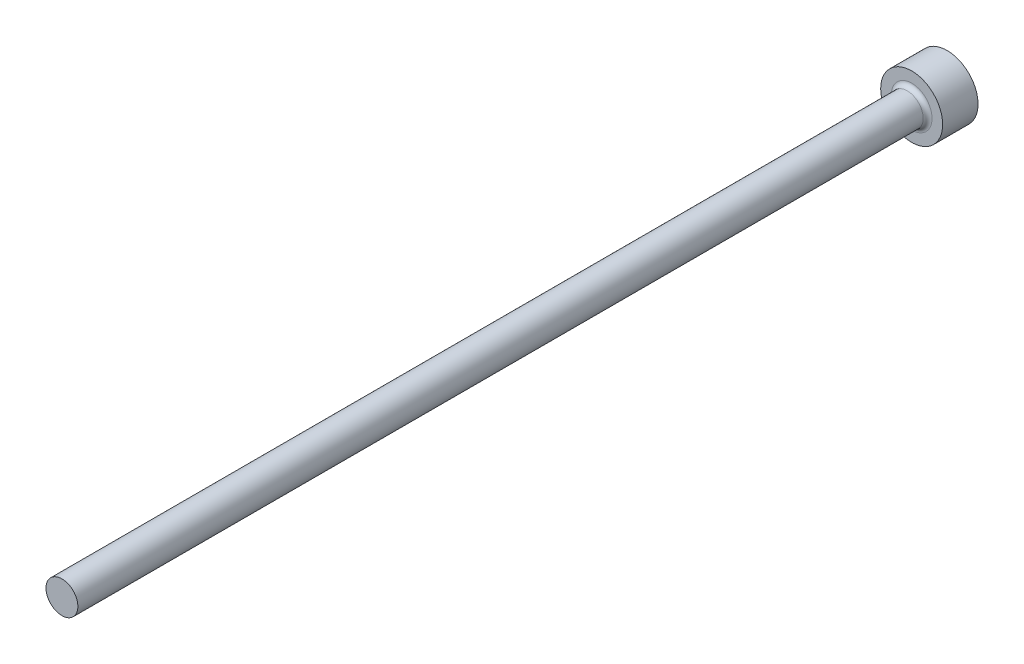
from build123d import *

# Parameters (mm, degrees)
FILLET1_R = 0.5


with BuildPart() as part:
    # FV → Revolve1 (revolve)
    with BuildSketch(Plane(origin=(0, 0, 0), x_dir=(1, 0, 0), z_dir=(0, 1, 0)), mode=Mode.PRIVATE) as revolve1_sk:
        Polygon((0, 0), (3.5, 0), (3.5, -4), (1.8, -4), (1.8, -100), (0, -100), align=None)
    revolve(revolve1_sk.sketch.rotate(Axis((0, 0, -9.033228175), (0, 0, 1)), 180), axis=Axis((0, 0, -9.033228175), (0, 0, 1)))

    # Fillet1
    fillet1_edges = [part.edges().sort_by_distance(p)[0] for p in [
        (1.8, 0, 4),
    ]]
    fillet(fillet1_edges, radius=FILLET1_R)


solid = part.part
